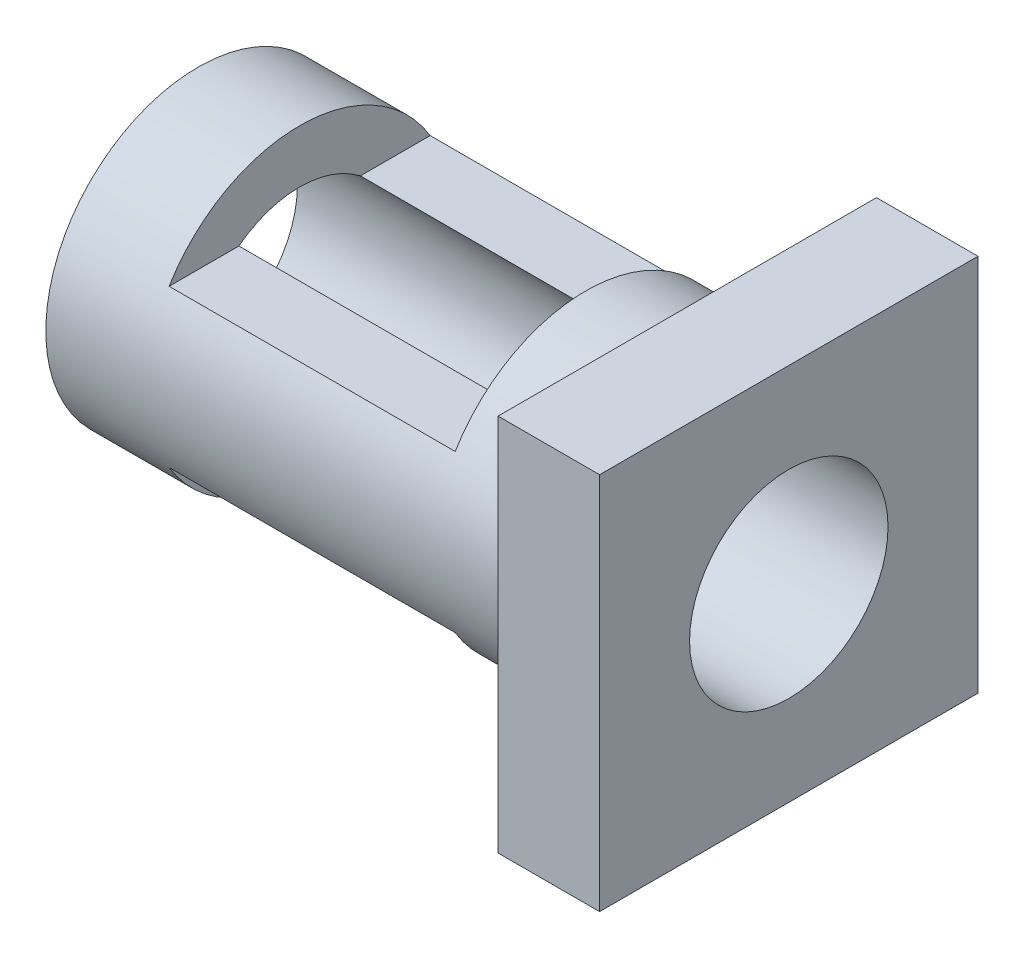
ISO-10303-21;
HEADER;
FILE_DESCRIPTION(('STEP AP214'),'2;1');
FILE_NAME('part.step','',(''),(''),'','','');
FILE_SCHEMA(('AUTOMOTIVE_DESIGN { 1 0 10303 214 1 1 1 1 }'));
ENDSEC;
DATA;
#1=APPLICATION_CONTEXT('core data for automotive mechanical design processes');
#2=APPLICATION_PROTOCOL_DEFINITION('international standard','automotive_design',2000,#1);
#3=PRODUCT_CONTEXT('',#1,'mechanical');
#4=PRODUCT('Part','Part','',(#3));
#5=PRODUCT_RELATED_PRODUCT_CATEGORY('part','',(#4));
#6=PRODUCT_DEFINITION_FORMATION('','',#4);
#7=PRODUCT_DEFINITION_CONTEXT('part definition',#1,'design');
#8=PRODUCT_DEFINITION('design','',#6,#7);
#9=PRODUCT_DEFINITION_SHAPE('','',#8);
#10=(LENGTH_UNIT() NAMED_UNIT(*) SI_UNIT(.MILLI.,.METRE.));
#11=(NAMED_UNIT(*) PLANE_ANGLE_UNIT() SI_UNIT($,.RADIAN.));
#12=(NAMED_UNIT(*) SI_UNIT($,.STERADIAN.) SOLID_ANGLE_UNIT());
#13=UNCERTAINTY_MEASURE_WITH_UNIT(LENGTH_MEASURE(1.E-05),#10,'distance_accuracy_value','');
#14=(GEOMETRIC_REPRESENTATION_CONTEXT(3) GLOBAL_UNCERTAINTY_ASSIGNED_CONTEXT((#13)) GLOBAL_UNIT_ASSIGNED_CONTEXT((#10,
#11,#12)) REPRESENTATION_CONTEXT('',''));
#15=CARTESIAN_POINT('',(0.,0.,0.));
#16=DIRECTION('',(0.,0.,1.));
#17=DIRECTION('',(1.,0.,0.));
#18=AXIS2_PLACEMENT_3D('',#15,#16,#17);
#19=CARTESIAN_POINT('',(-212.,0.,0.));
#20=DIRECTION('',(1.,0.,0.));
#21=DIRECTION('',(0.,0.,-1.));
#22=AXIS2_PLACEMENT_3D('',#19,#20,#21);
#23=CYLINDRICAL_SURFACE('',#22,66.);
#24=CARTESIAN_POINT('',(-168.,0.,0.));
#25=DIRECTION('',(-1.,0.,0.));
#26=DIRECTION('',(0.,-1.,0.));
#27=AXIS2_PLACEMENT_3D('',#24,#25,#26);
#28=CIRCLE('',#27,66.);
#29=CARTESIAN_POINT('',(-168.,-34.,56.5685424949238));
#30=VERTEX_POINT('',#29);
#31=CARTESIAN_POINT('',(-168.,-34.,-56.5685424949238));
#32=VERTEX_POINT('',#31);
#33=EDGE_CURVE('E203',#30,#32,#28,.F.);
#34=ORIENTED_EDGE('',*,*,#33,.F.);
#35=DIRECTION('',(1.,0.,0.));
#36=VECTOR('',#35,1.);
#37=CARTESIAN_POINT('',(-212.,-34.,56.5685424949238));
#38=LINE('',#37,#36);
#39=CARTESIAN_POINT('',(-44.,-34.,56.5685424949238));
#40=VERTEX_POINT('',#39);
#41=EDGE_CURVE('E208',#40,#30,#38,.F.);
#42=ORIENTED_EDGE('',*,*,#41,.F.);
#43=CARTESIAN_POINT('',(-44.,0.,0.));
#44=DIRECTION('',(1.,0.,0.));
#45=DIRECTION('',(0.,0.,-1.));
#46=AXIS2_PLACEMENT_3D('',#43,#44,#45);
#47=CIRCLE('',#46,66.);
#48=CARTESIAN_POINT('',(-44.,-34.,-56.5685424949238));
#49=VERTEX_POINT('',#48);
#50=EDGE_CURVE('E211',#49,#40,#47,.F.);
#51=ORIENTED_EDGE('',*,*,#50,.F.);
#52=DIRECTION('',(1.,0.,0.));
#53=VECTOR('',#52,1.);
#54=CARTESIAN_POINT('',(-212.,-34.,-56.5685424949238));
#55=LINE('',#54,#53);
#56=EDGE_CURVE('E129',#32,#49,#55,.T.);
#57=ORIENTED_EDGE('',*,*,#56,.F.);
#58=EDGE_LOOP('',(#34,#42,#51,#57));
#59=FACE_BOUND('',#58,.T.);
#60=DIRECTION('',(1.,0.,0.));
#61=VECTOR('',#60,1.);
#62=CARTESIAN_POINT('',(-212.,34.,-56.5685424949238));
#63=LINE('',#62,#61);
#64=CARTESIAN_POINT('',(-44.,34.,-56.5685424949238));
#65=VERTEX_POINT('',#64);
#66=CARTESIAN_POINT('',(-168.,34.,-56.5685424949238));
#67=VERTEX_POINT('',#66);
#68=EDGE_CURVE('E195',#65,#67,#63,.F.);
#69=ORIENTED_EDGE('',*,*,#68,.F.);
#70=CARTESIAN_POINT('',(-44.,0.,0.));
#71=DIRECTION('',(1.,0.,0.));
#72=DIRECTION('',(0.,1.,0.));
#73=AXIS2_PLACEMENT_3D('',#70,#71,#72);
#74=CIRCLE('',#73,66.);
#75=CARTESIAN_POINT('',(-44.,34.,56.5685424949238));
#76=VERTEX_POINT('',#75);
#77=EDGE_CURVE('E193',#76,#65,#74,.F.);
#78=ORIENTED_EDGE('',*,*,#77,.F.);
#79=DIRECTION('',(1.,0.,0.));
#80=VECTOR('',#79,1.);
#81=CARTESIAN_POINT('',(-212.,34.,56.5685424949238));
#82=LINE('',#81,#80);
#83=CARTESIAN_POINT('',(-168.,34.,56.5685424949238));
#84=VERTEX_POINT('',#83);
#85=EDGE_CURVE('E197',#84,#76,#82,.T.);
#86=ORIENTED_EDGE('',*,*,#85,.F.);
#87=CARTESIAN_POINT('',(-168.,0.,0.));
#88=DIRECTION('',(-1.,0.,0.));
#89=DIRECTION('',(0.,0.,1.));
#90=AXIS2_PLACEMENT_3D('',#87,#88,#89);
#91=CIRCLE('',#90,66.);
#92=EDGE_CURVE('E188',#67,#84,#91,.F.);
#93=ORIENTED_EDGE('',*,*,#92,.F.);
#94=EDGE_LOOP('',(#69,#78,#86,#93));
#95=FACE_BOUND('',#94,.T.);
#96=CARTESIAN_POINT('',(-212.,0.,0.));
#97=DIRECTION('',(1.,0.,0.));
#98=DIRECTION('',(0.,0.,-1.));
#99=AXIS2_PLACEMENT_3D('',#96,#97,#98);
#100=CIRCLE('',#99,66.);
#101=CARTESIAN_POINT('',(-212.,0.,-66.));
#102=VERTEX_POINT('',#101);
#103=EDGE_CURVE('E148',#102,#102,#100,.T.);
#104=ORIENTED_EDGE('',*,*,#103,.T.);
#105=EDGE_LOOP('',(#104));
#106=FACE_BOUND('',#105,.T.);
#107=CARTESIAN_POINT('',(0.,0.,0.));
#108=DIRECTION('',(1.,0.,0.));
#109=DIRECTION('',(0.,0.,-1.));
#110=AXIS2_PLACEMENT_3D('',#107,#108,#109);
#111=CIRCLE('',#110,66.);
#112=CARTESIAN_POINT('',(0.,0.,-66.));
#113=VERTEX_POINT('',#112);
#114=EDGE_CURVE('E149',#113,#113,#111,.T.);
#115=ORIENTED_EDGE('',*,*,#114,.F.);
#116=EDGE_LOOP('',(#115));
#117=FACE_BOUND('',#116,.T.);
#118=ADVANCED_FACE('F31',(#59,#95,#106,#117),#23,.T.);
#119=CARTESIAN_POINT('',(-212.,0.,0.));
#120=DIRECTION('',(1.,0.,0.));
#121=DIRECTION('',(0.,0.,-1.));
#122=AXIS2_PLACEMENT_3D('',#119,#120,#121);
#123=PLANE('',#122);
#124=CARTESIAN_POINT('',(-212.,0.,0.));
#125=DIRECTION('',(-1.,0.,0.));
#126=DIRECTION('',(0.,0.,1.));
#127=AXIS2_PLACEMENT_3D('',#124,#125,#126);
#128=CIRCLE('',#127,43.);
#129=CARTESIAN_POINT('',(-212.,0.,43.));
#130=VERTEX_POINT('',#129);
#131=EDGE_CURVE('E185',#130,#130,#128,.T.);
#132=ORIENTED_EDGE('',*,*,#131,.F.);
#133=EDGE_LOOP('',(#132));
#134=FACE_BOUND('',#133,.T.);
#135=ORIENTED_EDGE('',*,*,#103,.F.);
#136=EDGE_LOOP('',(#135));
#137=FACE_BOUND('',#136,.T.);
#138=ADVANCED_FACE('F232',(#134,#137),#123,.F.);
#139=CARTESIAN_POINT('',(44.,82.,82.));
#140=DIRECTION('',(0.,0.,-1.));
#141=DIRECTION('',(0.,1.,0.));
#142=AXIS2_PLACEMENT_3D('',#139,#140,#141);
#143=PLANE('',#142);
#144=DIRECTION('',(0.,-1.,0.));
#145=VECTOR('',#144,1.);
#146=CARTESIAN_POINT('',(0.,82.,82.));
#147=LINE('',#146,#145);
#148=CARTESIAN_POINT('',(0.,82.,82.));
#149=VERTEX_POINT('',#148);
#150=CARTESIAN_POINT('',(0.,-82.,82.));
#151=VERTEX_POINT('',#150);
#152=EDGE_CURVE('E174',#149,#151,#147,.T.);
#153=ORIENTED_EDGE('',*,*,#152,.T.);
#154=DIRECTION('',(-1.,0.,0.));
#155=VECTOR('',#154,1.);
#156=CARTESIAN_POINT('',(44.,-82.,82.));
#157=LINE('',#156,#155);
#158=CARTESIAN_POINT('',(44.,-82.,82.));
#159=VERTEX_POINT('',#158);
#160=EDGE_CURVE('E152',#159,#151,#157,.T.);
#161=ORIENTED_EDGE('',*,*,#160,.F.);
#162=DIRECTION('',(0.,-1.,0.));
#163=VECTOR('',#162,1.);
#164=CARTESIAN_POINT('',(44.,82.,82.));
#165=LINE('',#164,#163);
#166=CARTESIAN_POINT('',(44.,82.,82.));
#167=VERTEX_POINT('',#166);
#168=EDGE_CURVE('E169',#167,#159,#165,.T.);
#169=ORIENTED_EDGE('',*,*,#168,.F.);
#170=DIRECTION('',(-1.,0.,0.));
#171=VECTOR('',#170,1.);
#172=CARTESIAN_POINT('',(44.,82.,82.));
#173=LINE('',#172,#171);
#174=EDGE_CURVE('E163',#167,#149,#173,.T.);
#175=ORIENTED_EDGE('',*,*,#174,.T.);
#176=EDGE_LOOP('',(#153,#161,#169,#175));
#177=FACE_BOUND('',#176,.T.);
#178=ADVANCED_FACE('F236',(#177),#143,.F.);
#179=CARTESIAN_POINT('',(44.,-82.,82.));
#180=DIRECTION('',(0.,1.,0.));
#181=DIRECTION('',(0.,0.,1.));
#182=AXIS2_PLACEMENT_3D('',#179,#180,#181);
#183=PLANE('',#182);
#184=DIRECTION('',(0.,0.,-1.));
#185=VECTOR('',#184,1.);
#186=CARTESIAN_POINT('',(0.,-82.,82.));
#187=LINE('',#186,#185);
#188=CARTESIAN_POINT('',(0.,-82.,-82.));
#189=VERTEX_POINT('',#188);
#190=EDGE_CURVE('E172',#151,#189,#187,.T.);
#191=ORIENTED_EDGE('',*,*,#190,.T.);
#192=DIRECTION('',(-1.,0.,0.));
#193=VECTOR('',#192,1.);
#194=CARTESIAN_POINT('',(44.,-82.,-82.));
#195=LINE('',#194,#193);
#196=CARTESIAN_POINT('',(44.,-82.,-82.));
#197=VERTEX_POINT('',#196);
#198=EDGE_CURVE('E157',#197,#189,#195,.T.);
#199=ORIENTED_EDGE('',*,*,#198,.F.);
#200=DIRECTION('',(0.,0.,-1.));
#201=VECTOR('',#200,1.);
#202=CARTESIAN_POINT('',(44.,-82.,82.));
#203=LINE('',#202,#201);
#204=EDGE_CURVE('E181',#159,#197,#203,.T.);
#205=ORIENTED_EDGE('',*,*,#204,.F.);
#206=ORIENTED_EDGE('',*,*,#160,.T.);
#207=EDGE_LOOP('',(#191,#199,#205,#206));
#208=FACE_BOUND('',#207,.T.);
#209=ADVANCED_FACE('F241',(#208),#183,.F.);
#210=CARTESIAN_POINT('',(44.,82.,-82.));
#211=DIRECTION('',(0.,0.,1.));
#212=DIRECTION('',(0.,-1.,0.));
#213=AXIS2_PLACEMENT_3D('',#210,#211,#212);
#214=PLANE('',#213);
#215=DIRECTION('',(0.,1.,0.));
#216=VECTOR('',#215,1.);
#217=CARTESIAN_POINT('',(0.,82.,-82.));
#218=LINE('',#217,#216);
#219=CARTESIAN_POINT('',(0.,82.,-82.));
#220=VERTEX_POINT('',#219);
#221=EDGE_CURVE('E170',#189,#220,#218,.T.);
#222=ORIENTED_EDGE('',*,*,#221,.T.);
#223=DIRECTION('',(-1.,0.,0.));
#224=VECTOR('',#223,1.);
#225=CARTESIAN_POINT('',(44.,82.,-82.));
#226=LINE('',#225,#224);
#227=CARTESIAN_POINT('',(44.,82.,-82.));
#228=VERTEX_POINT('',#227);
#229=EDGE_CURVE('E160',#228,#220,#226,.T.);
#230=ORIENTED_EDGE('',*,*,#229,.F.);
#231=DIRECTION('',(0.,1.,0.));
#232=VECTOR('',#231,1.);
#233=CARTESIAN_POINT('',(44.,82.,-82.));
#234=LINE('',#233,#232);
#235=EDGE_CURVE('E179',#197,#228,#234,.T.);
#236=ORIENTED_EDGE('',*,*,#235,.F.);
#237=ORIENTED_EDGE('',*,*,#198,.T.);
#238=EDGE_LOOP('',(#222,#230,#236,#237));
#239=FACE_BOUND('',#238,.T.);
#240=ADVANCED_FACE('F249',(#239),#214,.F.);
#241=CARTESIAN_POINT('',(44.,82.,82.));
#242=DIRECTION('',(0.,-1.,0.));
#243=DIRECTION('',(0.,0.,-1.));
#244=AXIS2_PLACEMENT_3D('',#241,#242,#243);
#245=PLANE('',#244);
#246=DIRECTION('',(0.,0.,1.));
#247=VECTOR('',#246,1.);
#248=CARTESIAN_POINT('',(0.,82.,82.));
#249=LINE('',#248,#247);
#250=EDGE_CURVE('E167',#220,#149,#249,.T.);
#251=ORIENTED_EDGE('',*,*,#250,.T.);
#252=ORIENTED_EDGE('',*,*,#174,.F.);
#253=DIRECTION('',(0.,0.,1.));
#254=VECTOR('',#253,1.);
#255=CARTESIAN_POINT('',(44.,82.,82.));
#256=LINE('',#255,#254);
#257=EDGE_CURVE('E166',#228,#167,#256,.T.);
#258=ORIENTED_EDGE('',*,*,#257,.F.);
#259=ORIENTED_EDGE('',*,*,#229,.T.);
#260=EDGE_LOOP('',(#251,#252,#258,#259));
#261=FACE_BOUND('',#260,.T.);
#262=ADVANCED_FACE('F253',(#261),#245,.F.);
#263=CARTESIAN_POINT('',(44.,-82.,82.));
#264=DIRECTION('',(1.,0.,0.));
#265=DIRECTION('',(0.,0.,-1.));
#266=AXIS2_PLACEMENT_3D('',#263,#264,#265);
#267=PLANE('',#266);
#268=CARTESIAN_POINT('',(44.,0.,0.));
#269=DIRECTION('',(-1.,0.,0.));
#270=DIRECTION('',(0.,0.,1.));
#271=AXIS2_PLACEMENT_3D('',#268,#269,#270);
#272=CIRCLE('',#271,43.);
#273=CARTESIAN_POINT('',(44.,0.,43.));
#274=VERTEX_POINT('',#273);
#275=EDGE_CURVE('E177',#274,#274,#272,.T.);
#276=ORIENTED_EDGE('',*,*,#275,.T.);
#277=EDGE_LOOP('',(#276));
#278=FACE_BOUND('',#277,.T.);
#279=ORIENTED_EDGE('',*,*,#168,.T.);
#280=ORIENTED_EDGE('',*,*,#204,.T.);
#281=ORIENTED_EDGE('',*,*,#235,.T.);
#282=ORIENTED_EDGE('',*,*,#257,.T.);
#283=EDGE_LOOP('',(#279,#280,#281,#282));
#284=FACE_BOUND('',#283,.T.);
#285=ADVANCED_FACE('F257',(#278,#284),#267,.T.);
#286=CARTESIAN_POINT('',(0.,-82.,82.));
#287=DIRECTION('',(1.,0.,0.));
#288=DIRECTION('',(0.,0.,-1.));
#289=AXIS2_PLACEMENT_3D('',#286,#287,#288);
#290=PLANE('',#289);
#291=ORIENTED_EDGE('',*,*,#114,.T.);
#292=EDGE_LOOP('',(#291));
#293=FACE_BOUND('',#292,.T.);
#294=ORIENTED_EDGE('',*,*,#152,.F.);
#295=ORIENTED_EDGE('',*,*,#250,.F.);
#296=ORIENTED_EDGE('',*,*,#221,.F.);
#297=ORIENTED_EDGE('',*,*,#190,.F.);
#298=EDGE_LOOP('',(#294,#295,#296,#297));
#299=FACE_BOUND('',#298,.T.);
#300=ADVANCED_FACE('F259',(#293,#299),#290,.F.);
#301=CARTESIAN_POINT('',(44.,0.,0.));
#302=DIRECTION('',(-1.,0.,0.));
#303=DIRECTION('',(0.,0.,1.));
#304=AXIS2_PLACEMENT_3D('',#301,#302,#303);
#305=CYLINDRICAL_SURFACE('',#304,43.);
#306=DIRECTION('',(-1.,0.,0.));
#307=VECTOR('',#306,1.);
#308=CARTESIAN_POINT('',(44.,-34.,26.3248931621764));
#309=LINE('',#308,#307);
#310=CARTESIAN_POINT('',(-44.,-34.,26.3248931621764));
#311=VERTEX_POINT('',#310);
#312=CARTESIAN_POINT('',(-168.,-34.,26.3248931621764));
#313=VERTEX_POINT('',#312);
#314=EDGE_CURVE('E121',#311,#313,#309,.T.);
#315=ORIENTED_EDGE('',*,*,#314,.T.);
#316=CARTESIAN_POINT('',(-168.,0.,0.));
#317=DIRECTION('',(-1.,0.,0.));
#318=DIRECTION('',(0.,-1.,0.));
#319=AXIS2_PLACEMENT_3D('',#316,#317,#318);
#320=CIRCLE('',#319,43.);
#321=CARTESIAN_POINT('',(-168.,-34.,-26.3248931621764));
#322=VERTEX_POINT('',#321);
#323=EDGE_CURVE('E11',#313,#322,#320,.F.);
#324=ORIENTED_EDGE('',*,*,#323,.T.);
#325=DIRECTION('',(-1.,0.,0.));
#326=VECTOR('',#325,1.);
#327=CARTESIAN_POINT('',(44.,-34.,-26.3248931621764));
#328=LINE('',#327,#326);
#329=CARTESIAN_POINT('',(-44.,-34.,-26.3248931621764));
#330=VERTEX_POINT('',#329);
#331=EDGE_CURVE('E38',#322,#330,#328,.F.);
#332=ORIENTED_EDGE('',*,*,#331,.T.);
#333=CARTESIAN_POINT('',(-44.,0.,0.));
#334=DIRECTION('',(1.,0.,0.));
#335=DIRECTION('',(0.,0.,-1.));
#336=AXIS2_PLACEMENT_3D('',#333,#334,#335);
#337=CIRCLE('',#336,43.);
#338=EDGE_CURVE('E116',#330,#311,#337,.F.);
#339=ORIENTED_EDGE('',*,*,#338,.T.);
#340=EDGE_LOOP('',(#315,#324,#332,#339));
#341=FACE_BOUND('',#340,.T.);
#342=CARTESIAN_POINT('',(-168.,0.,0.));
#343=DIRECTION('',(-1.,0.,0.));
#344=DIRECTION('',(0.,0.,1.));
#345=AXIS2_PLACEMENT_3D('',#342,#343,#344);
#346=CIRCLE('',#345,43.);
#347=CARTESIAN_POINT('',(-168.,34.,-26.3248931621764));
#348=VERTEX_POINT('',#347);
#349=CARTESIAN_POINT('',(-168.,34.,26.3248931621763));
#350=VERTEX_POINT('',#349);
#351=EDGE_CURVE('E139',#348,#350,#346,.F.);
#352=ORIENTED_EDGE('',*,*,#351,.T.);
#353=DIRECTION('',(-1.,0.,0.));
#354=VECTOR('',#353,1.);
#355=CARTESIAN_POINT('',(44.,34.,26.3248931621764));
#356=LINE('',#355,#354);
#357=CARTESIAN_POINT('',(-44.,34.,26.3248931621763));
#358=VERTEX_POINT('',#357);
#359=EDGE_CURVE('E122',#350,#358,#356,.F.);
#360=ORIENTED_EDGE('',*,*,#359,.T.);
#361=CARTESIAN_POINT('',(-44.,0.,0.));
#362=DIRECTION('',(1.,0.,0.));
#363=DIRECTION('',(0.,1.,0.));
#364=AXIS2_PLACEMENT_3D('',#361,#362,#363);
#365=CIRCLE('',#364,43.);
#366=CARTESIAN_POINT('',(-44.,34.,-26.3248931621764));
#367=VERTEX_POINT('',#366);
#368=EDGE_CURVE('E142',#358,#367,#365,.F.);
#369=ORIENTED_EDGE('',*,*,#368,.T.);
#370=DIRECTION('',(-1.,0.,0.));
#371=VECTOR('',#370,1.);
#372=CARTESIAN_POINT('',(44.,34.,-26.3248931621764));
#373=LINE('',#372,#371);
#374=EDGE_CURVE('E145',#367,#348,#373,.T.);
#375=ORIENTED_EDGE('',*,*,#374,.T.);
#376=EDGE_LOOP('',(#352,#360,#369,#375));
#377=FACE_BOUND('',#376,.T.);
#378=ORIENTED_EDGE('',*,*,#275,.F.);
#379=EDGE_LOOP('',(#378));
#380=FACE_BOUND('',#379,.T.);
#381=ORIENTED_EDGE('',*,*,#131,.T.);
#382=EDGE_LOOP('',(#381));
#383=FACE_BOUND('',#382,.T.);
#384=ADVANCED_FACE('F133',(#341,#377,#380,#383),#305,.F.);
#385=CARTESIAN_POINT('',(-168.,79.1252415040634,-82.));
#386=DIRECTION('',(-1.,0.,0.));
#387=DIRECTION('',(0.,0.,1.));
#388=AXIS2_PLACEMENT_3D('',#385,#386,#387);
#389=PLANE('',#388);
#390=ORIENTED_EDGE('',*,*,#92,.T.);
#391=DIRECTION('',(0.,0.,1.));
#392=VECTOR('',#391,1.);
#393=CARTESIAN_POINT('',(-168.,34.,-82.));
#394=LINE('',#393,#392);
#395=EDGE_CURVE('E200',#350,#84,#394,.T.);
#396=ORIENTED_EDGE('',*,*,#395,.F.);
#397=ORIENTED_EDGE('',*,*,#351,.F.);
#398=EDGE_CURVE('E202',#67,#348,#394,.T.);
#399=ORIENTED_EDGE('',*,*,#398,.F.);
#400=EDGE_LOOP('',(#390,#396,#397,#399));
#401=FACE_BOUND('',#400,.T.);
#402=ADVANCED_FACE('F268',(#401),#389,.F.);
#403=CARTESIAN_POINT('',(-44.,79.1252415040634,-82.));
#404=DIRECTION('',(1.,0.,0.));
#405=DIRECTION('',(0.,1.,0.));
#406=AXIS2_PLACEMENT_3D('',#403,#404,#405);
#407=PLANE('',#406);
#408=ORIENTED_EDGE('',*,*,#77,.T.);
#409=DIRECTION('',(0.,0.,1.));
#410=VECTOR('',#409,1.);
#411=CARTESIAN_POINT('',(-44.,34.,-82.));
#412=LINE('',#411,#410);
#413=EDGE_CURVE('E199',#65,#367,#412,.T.);
#414=ORIENTED_EDGE('',*,*,#413,.T.);
#415=ORIENTED_EDGE('',*,*,#368,.F.);
#416=EDGE_CURVE('E204',#358,#76,#412,.T.);
#417=ORIENTED_EDGE('',*,*,#416,.T.);
#418=EDGE_LOOP('',(#408,#414,#415,#417));
#419=FACE_BOUND('',#418,.T.);
#420=ADVANCED_FACE('F271',(#419),#407,.F.);
#421=CARTESIAN_POINT('',(-168.,34.,-82.));
#422=DIRECTION('',(0.,-1.,0.));
#423=DIRECTION('',(0.,0.,-1.));
#424=AXIS2_PLACEMENT_3D('',#421,#422,#423);
#425=PLANE('',#424);
#426=ORIENTED_EDGE('',*,*,#85,.T.);
#427=ORIENTED_EDGE('',*,*,#416,.F.);
#428=ORIENTED_EDGE('',*,*,#359,.F.);
#429=ORIENTED_EDGE('',*,*,#395,.T.);
#430=EDGE_LOOP('',(#426,#427,#428,#429));
#431=FACE_BOUND('',#430,.T.);
#432=ADVANCED_FACE('F273',(#431),#425,.F.);
#433=ORIENTED_EDGE('',*,*,#68,.T.);
#434=ORIENTED_EDGE('',*,*,#398,.T.);
#435=ORIENTED_EDGE('',*,*,#374,.F.);
#436=ORIENTED_EDGE('',*,*,#413,.F.);
#437=EDGE_LOOP('',(#433,#434,#435,#436));
#438=FACE_BOUND('',#437,.T.);
#439=ADVANCED_FACE('F276',(#438),#425,.F.);
#440=CARTESIAN_POINT('',(-168.,-34.,-82.));
#441=DIRECTION('',(-1.,0.,0.));
#442=DIRECTION('',(0.,-1.,0.));
#443=AXIS2_PLACEMENT_3D('',#440,#441,#442);
#444=PLANE('',#443);
#445=ORIENTED_EDGE('',*,*,#33,.T.);
#446=DIRECTION('',(0.,0.,1.));
#447=VECTOR('',#446,1.);
#448=CARTESIAN_POINT('',(-168.,-34.,-82.));
#449=LINE('',#448,#447);
#450=EDGE_CURVE('E212',#32,#322,#449,.T.);
#451=ORIENTED_EDGE('',*,*,#450,.T.);
#452=ORIENTED_EDGE('',*,*,#323,.F.);
#453=EDGE_CURVE('E131',#313,#30,#449,.T.);
#454=ORIENTED_EDGE('',*,*,#453,.T.);
#455=EDGE_LOOP('',(#445,#451,#452,#454));
#456=FACE_BOUND('',#455,.T.);
#457=ADVANCED_FACE('F218',(#456),#444,.F.);
#458=CARTESIAN_POINT('',(-168.,-34.,-82.));
#459=DIRECTION('',(0.,1.,0.));
#460=DIRECTION('',(-1.,0.,0.));
#461=AXIS2_PLACEMENT_3D('',#458,#459,#460);
#462=PLANE('',#461);
#463=ORIENTED_EDGE('',*,*,#56,.T.);
#464=DIRECTION('',(0.,0.,1.));
#465=VECTOR('',#464,1.);
#466=CARTESIAN_POINT('',(-44.,-34.,-82.));
#467=LINE('',#466,#465);
#468=EDGE_CURVE('E45',#49,#330,#467,.T.);
#469=ORIENTED_EDGE('',*,*,#468,.T.);
#470=ORIENTED_EDGE('',*,*,#331,.F.);
#471=ORIENTED_EDGE('',*,*,#450,.F.);
#472=EDGE_LOOP('',(#463,#469,#470,#471));
#473=FACE_BOUND('',#472,.T.);
#474=ADVANCED_FACE('F125',(#473),#462,.F.);
#475=ORIENTED_EDGE('',*,*,#41,.T.);
#476=ORIENTED_EDGE('',*,*,#453,.F.);
#477=ORIENTED_EDGE('',*,*,#314,.F.);
#478=EDGE_CURVE('E50',#311,#40,#467,.T.);
#479=ORIENTED_EDGE('',*,*,#478,.T.);
#480=EDGE_LOOP('',(#475,#476,#477,#479));
#481=FACE_BOUND('',#480,.T.);
#482=ADVANCED_FACE('F223',(#481),#462,.F.);
#483=CARTESIAN_POINT('',(-44.,-34.,-82.));
#484=DIRECTION('',(1.,0.,0.));
#485=DIRECTION('',(0.,0.,-1.));
#486=AXIS2_PLACEMENT_3D('',#483,#484,#485);
#487=PLANE('',#486);
#488=ORIENTED_EDGE('',*,*,#50,.T.);
#489=ORIENTED_EDGE('',*,*,#478,.F.);
#490=ORIENTED_EDGE('',*,*,#338,.F.);
#491=ORIENTED_EDGE('',*,*,#468,.F.);
#492=EDGE_LOOP('',(#488,#489,#490,#491));
#493=FACE_BOUND('',#492,.T.);
#494=ADVANCED_FACE('F117',(#493),#487,.F.);
#495=CLOSED_SHELL('',(#118,#138,#178,#209,#240,#262,#285,#300,#384,#402,#420,#432,#439,#457,
#474,#482,#494));
#496=MANIFOLD_SOLID_BREP('B2',#495);
#497=ADVANCED_BREP_SHAPE_REPRESENTATION('',(#18,#496),#14);
#498=SHAPE_DEFINITION_REPRESENTATION(#9,#497);
ENDSEC;
END-ISO-10303-21;
